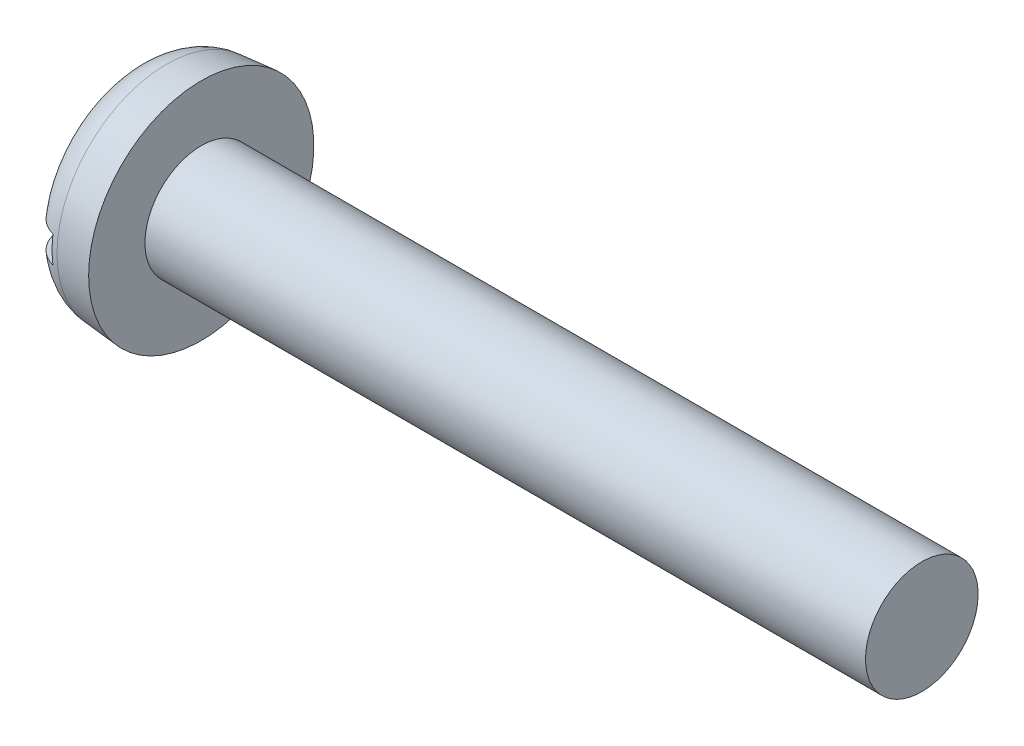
from build123d import *

# Parameters (mm, degrees)
FILLET2_R  = 0.8
SKETCH2_W  = 5
SKETCH2_H  = 0.6
SLOT_DEPTH = 0.6


with BuildPart() as part:
    # BodySke → Base-Revolve (revolve)
    with BuildSketch(Plane.XY, mode=Mode.PRIVATE) as base_revolve_sk:
        Polygon((1.5, 1.25), (1.5, 2.5), (0, 2.368767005), (0, 0), (17.5, 0), (17.5, 1.25), align=None)
    revolve(base_revolve_sk.sketch.rotate(Axis((-25.4, 0, 0), (1, 0, 0)), 90), axis=Axis((-25.4, 0, 0), (1, 0, 0)))

    # Fillet2
    fillet2_edges = [part.edges().sort_by_distance(p)[0] for p in [
        (0, 0, -2.368767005),
    ]]
    fillet(fillet2_edges, radius=FILLET2_R)

    # Sketch2 → Slot (cut)
    with BuildSketch(Plane(origin=(0, 0, 0), x_dir=(0, 0, -1), z_dir=(1, 0, 0))):
        Rectangle(SKETCH2_W, SKETCH2_H)
    extrude(amount=SLOT_DEPTH, mode=Mode.SUBTRACT)


solid = part.part
